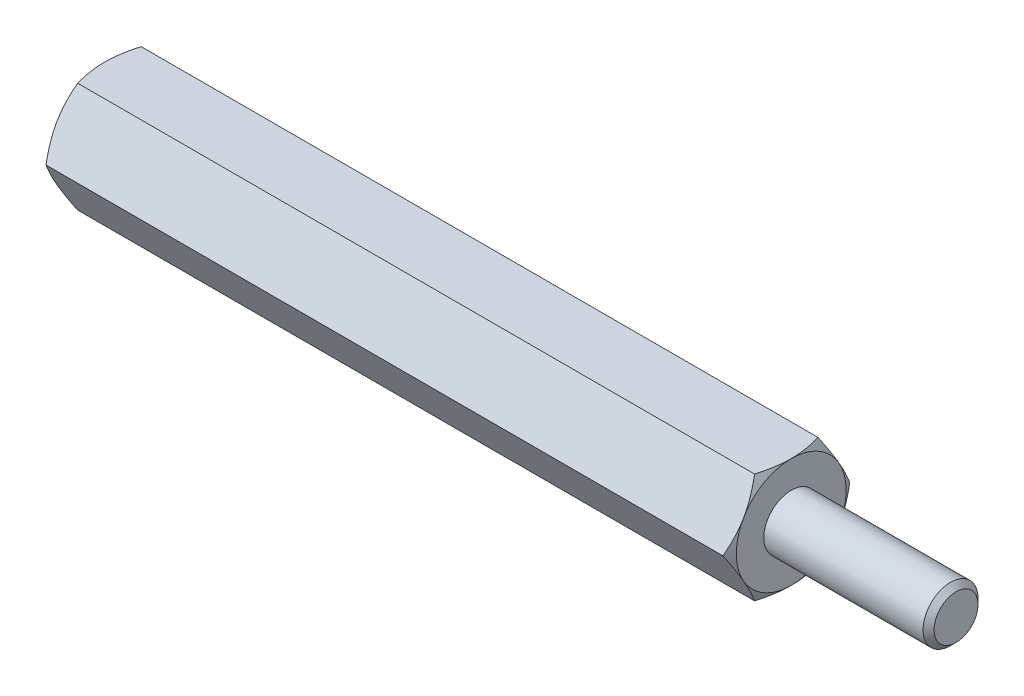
from build123d import *

# Parameters (mm, degrees)
EXTRUDE2_DEPTH = 12.5
SKETCH3_R      = 0.8
EXTRUDE3_DEPTH = 6
SKETCH5_R      = 1
EXTRUDE4_DEPTH = 6
CHAMFER1_SIZE  = 0.2


with BuildPart() as part:
    # Sketch1 → Extrude2 (new, symmetric)
    with BuildSketch(Plane(origin=(0, 0, 0), x_dir=(0, 0, -1), z_dir=(1, 0, 0))):
        Polygon((1.154700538, 2), (-1.154700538, 2), (-2.309401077, 0), (-1.154700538, -2), (1.154700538, -2), (2.309401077, 0), align=None)
    extrude(amount=EXTRUDE2_DEPTH, both=True)

    # Sketch2 → Cut-Revolve1 (revolve, cut)
    with BuildSketch(Plane.XY):
        with BuildLine():
            Line((-12.5, 2), (-11, 4.598076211))
            ThreePointArc((-11, 4.598076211), (-11.48810136, 5.776457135), (-12.5, 5))
            Line((-12.5, 5), (-12.5, 2))
        make_face()
    cut_revolve1 = revolve(axis=Axis((0, 0, 0), (1, 0, 0)), mode=Mode.SUBTRACT)

    # Mirror1: Cut-Revolve1 across plane
    add(cut_revolve1.mirror(Plane(origin=(0, 0, 0), x_dir=(0, 0, 1), z_dir=(1, 0, 0))), mode=Mode.SUBTRACT)

    # Sketch3 → Extrude3 (cut)
    with BuildSketch(Plane.ZY.offset(12.5)):
        Circle(SKETCH3_R)
    extrude(amount=-EXTRUDE3_DEPTH, mode=Mode.SUBTRACT)

    # Sketch4 → Cut-Revolve2 (revolve, cut)
    with BuildSketch(Plane.XY, mode=Mode.PRIVATE) as cut_revolve2_sk:
        Polygon((-6.5, 0), (-6.5, 0.8), (-6.038119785, 0), align=None)
    revolve(cut_revolve2_sk.sketch.rotate(Axis((-6.038119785, 0, 0), (-1, 0, 0)), 270), axis=Axis((-6.038119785, 0, 0), (-1, 0, 0)), mode=Mode.SUBTRACT)

    # Sketch5 → Extrude4 (add)
    with BuildSketch(Plane(origin=(12.5, 0, 0), x_dir=(0, 0, -1), z_dir=(1, 0, 0))):
        Circle(SKETCH5_R)
    extrude(amount=EXTRUDE4_DEPTH)

    # Chamfer1
    chamfer1_edges = [part.edges().sort_by_distance(p)[0] for p in [
        (18.5, 0, 1),
    ]]
    chamfer(chamfer1_edges, length=CHAMFER1_SIZE)


solid = part.part
